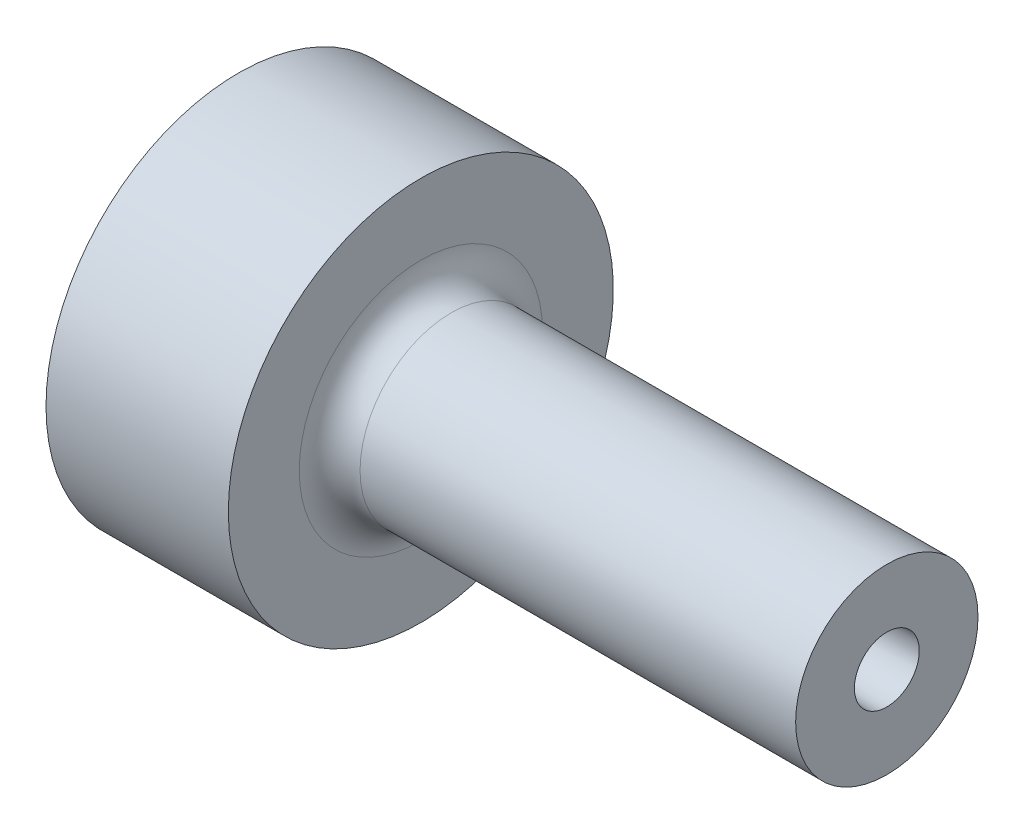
ISO-10303-21;
HEADER;
FILE_DESCRIPTION(('STEP AP214'),'2;1');
FILE_NAME('part.step','',(''),(''),'','','');
FILE_SCHEMA(('AUTOMOTIVE_DESIGN { 1 0 10303 214 1 1 1 1 }'));
ENDSEC;
DATA;
#1=APPLICATION_CONTEXT('core data for automotive mechanical design processes');
#2=APPLICATION_PROTOCOL_DEFINITION('international standard','automotive_design',2000,#1);
#3=PRODUCT_CONTEXT('',#1,'mechanical');
#4=PRODUCT('Part','Part','',(#3));
#5=PRODUCT_RELATED_PRODUCT_CATEGORY('part','',(#4));
#6=PRODUCT_DEFINITION_FORMATION('','',#4);
#7=PRODUCT_DEFINITION_CONTEXT('part definition',#1,'design');
#8=PRODUCT_DEFINITION('design','',#6,#7);
#9=PRODUCT_DEFINITION_SHAPE('','',#8);
#10=(LENGTH_UNIT() NAMED_UNIT(*) SI_UNIT(.MILLI.,.METRE.));
#11=(NAMED_UNIT(*) PLANE_ANGLE_UNIT() SI_UNIT($,.RADIAN.));
#12=(NAMED_UNIT(*) SI_UNIT($,.STERADIAN.) SOLID_ANGLE_UNIT());
#13=UNCERTAINTY_MEASURE_WITH_UNIT(LENGTH_MEASURE(1.E-05),#10,'distance_accuracy_value','');
#14=(GEOMETRIC_REPRESENTATION_CONTEXT(3) GLOBAL_UNCERTAINTY_ASSIGNED_CONTEXT((#13)) GLOBAL_UNIT_ASSIGNED_CONTEXT((#10,
#11,#12)) REPRESENTATION_CONTEXT('',''));
#15=CARTESIAN_POINT('',(0.,0.,0.));
#16=DIRECTION('',(0.,0.,1.));
#17=DIRECTION('',(1.,0.,0.));
#18=AXIS2_PLACEMENT_3D('',#15,#16,#17);
#19=CARTESIAN_POINT('',(0.,0.,0.));
#20=DIRECTION('',(-1.,0.,0.));
#21=DIRECTION('',(0.,0.,1.));
#22=AXIS2_PLACEMENT_3D('',#19,#20,#21);
#23=CYLINDRICAL_SURFACE('',#22,19.);
#24=CARTESIAN_POINT('',(18.,0.,0.));
#25=DIRECTION('',(-1.,0.,0.));
#26=DIRECTION('',(0.,0.,1.));
#27=AXIS2_PLACEMENT_3D('',#24,#25,#26);
#28=CIRCLE('',#27,19.);
#29=CARTESIAN_POINT('',(18.,0.,19.));
#30=VERTEX_POINT('',#29);
#31=EDGE_CURVE('E91',#30,#30,#28,.T.);
#32=ORIENTED_EDGE('',*,*,#31,.T.);
#33=EDGE_LOOP('',(#32));
#34=FACE_BOUND('',#33,.T.);
#35=CARTESIAN_POINT('',(0.,0.,0.));
#36=DIRECTION('',(-1.,0.,0.));
#37=DIRECTION('',(0.,0.,1.));
#38=AXIS2_PLACEMENT_3D('',#35,#36,#37);
#39=CIRCLE('',#38,19.);
#40=CARTESIAN_POINT('',(0.,0.,19.));
#41=VERTEX_POINT('',#40);
#42=EDGE_CURVE('E85',#41,#41,#39,.T.);
#43=ORIENTED_EDGE('',*,*,#42,.F.);
#44=EDGE_LOOP('',(#43));
#45=FACE_BOUND('',#44,.T.);
#46=CARTESIAN_POINT('',(11.,-19.,0.));
#47=CARTESIAN_POINT('',(10.9999951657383,-18.9999986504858,0.11200841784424));
#48=CARTESIAN_POINT('',(10.9905588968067,-18.9989990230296,0.224090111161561));
#49=CARTESIAN_POINT('',(10.953059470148,-18.9951074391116,0.445143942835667));
#50=CARTESIAN_POINT('',(10.9249759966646,-18.9922134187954,0.554112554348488));
#51=CARTESIAN_POINT('',(10.8510107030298,-18.9848596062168,0.765707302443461));
#52=CARTESIAN_POINT('',(10.8051398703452,-18.9804007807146,0.868337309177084));
#53=CARTESIAN_POINT('',(10.696923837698,-18.9704154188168,1.06441973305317));
#54=CARTESIAN_POINT('',(10.6345818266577,-18.9648890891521,1.15787392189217));
#55=CARTESIAN_POINT('',(10.494927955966,-18.9533628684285,1.33334438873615));
#56=CARTESIAN_POINT('',(10.417564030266,-18.9473613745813,1.41531912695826));
#57=CARTESIAN_POINT('',(10.2501736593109,-18.9355744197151,1.565146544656));
#58=CARTESIAN_POINT('',(10.1601466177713,-18.9297889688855,1.63299855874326));
#59=CARTESIAN_POINT('',(9.96972339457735,-18.9190729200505,1.75280323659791));
#60=CARTESIAN_POINT('',(9.86930325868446,-18.914144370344,1.80471802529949));
#61=CARTESIAN_POINT('',(9.66111022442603,-18.9057203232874,1.89093273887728));
#62=CARTESIAN_POINT('',(9.55333752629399,-18.90222478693,1.92523314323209));
#63=CARTESIAN_POINT('',(9.333924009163,-18.8970772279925,1.97512160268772));
#64=CARTESIAN_POINT('',(9.22229908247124,-18.89541839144,1.99077883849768));
#65=CARTESIAN_POINT('',(8.99799439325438,-18.8941109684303,2.0031504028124));
#66=CARTESIAN_POINT('',(8.88531466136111,-18.8944623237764,1.99986527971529));
#67=CARTESIAN_POINT('',(8.66257681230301,-18.8971293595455,1.97450235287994));
#68=CARTESIAN_POINT('',(8.55250997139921,-18.8994371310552,1.9525002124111));
#69=CARTESIAN_POINT('',(8.33763983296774,-18.9057446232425,1.89044560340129));
#70=CARTESIAN_POINT('',(8.23283661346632,-18.9097443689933,1.85039286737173));
#71=CARTESIAN_POINT('',(8.0312304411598,-18.9189942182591,1.75329092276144));
#72=CARTESIAN_POINT('',(7.93444370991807,-18.924246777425,1.69620827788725));
#73=CARTESIAN_POINT('',(7.75179548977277,-18.9354083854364,1.5666908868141));
#74=CARTESIAN_POINT('',(7.66593435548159,-18.9413174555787,1.49425564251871));
#75=CARTESIAN_POINT('',(7.50713503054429,-18.9531615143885,1.33566725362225));
#76=CARTESIAN_POINT('',(7.43426205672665,-18.9590964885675,1.24944878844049));
#77=CARTESIAN_POINT('',(7.30401357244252,-18.9702964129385,1.06596783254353));
#78=CARTESIAN_POINT('',(7.24663808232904,-18.9755613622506,0.968705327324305));
#79=CARTESIAN_POINT('',(7.14901535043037,-18.9848300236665,0.765851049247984));
#80=CARTESIAN_POINT('',(7.10877156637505,-18.9888334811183,0.660257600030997));
#81=CARTESIAN_POINT('',(7.04660317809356,-18.9951255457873,0.443760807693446));
#82=CARTESIAN_POINT('',(7.02467796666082,-18.9974142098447,0.332857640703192));
#83=CARTESIAN_POINT('',(6.9998521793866,-19.0000115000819,0.109454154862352));
#84=CARTESIAN_POINT('',(6.9968616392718,-19.0003294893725,-0.00303606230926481));
#85=CARTESIAN_POINT('',(7.00975357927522,-18.9989747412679,-0.226916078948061));
#86=CARTESIAN_POINT('',(7.02563577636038,-18.9973020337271,-0.338305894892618));
#87=CARTESIAN_POINT('',(7.07574769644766,-18.9921598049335,-0.556562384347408));
#88=CARTESIAN_POINT('',(7.10993514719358,-18.9886944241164,-0.663438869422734));
#89=CARTESIAN_POINT('',(7.1956435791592,-18.9803554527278,-0.869940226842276));
#90=CARTESIAN_POINT('',(7.24716498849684,-18.9754818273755,-0.969564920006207));
#91=CARTESIAN_POINT('',(7.36630089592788,-18.9648478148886,-1.1591405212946));
#92=CARTESIAN_POINT('',(7.43397432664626,-18.9590842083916,-1.2490542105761));
#93=CARTESIAN_POINT('',(7.58340899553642,-18.9473268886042,-1.4162783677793));
#94=CARTESIAN_POINT('',(7.665170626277,-18.9413331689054,-1.49358848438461));
#95=CARTESIAN_POINT('',(7.84085406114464,-18.9297628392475,-1.63372463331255));
#96=CARTESIAN_POINT('',(7.93482318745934,-18.9241879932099,-1.69649150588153));
#97=CARTESIAN_POINT('',(8.13202150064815,-18.9141138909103,-1.80535237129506));
#98=CARTESIAN_POINT('',(8.23525054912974,-18.9096146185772,-1.85144661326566));
#99=CARTESIAN_POINT('',(8.44783784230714,-18.9022123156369,-1.9255553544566));
#100=CARTESIAN_POINT('',(8.55718382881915,-18.8993062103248,-1.95360469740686));
#101=CARTESIAN_POINT('',(8.77906579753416,-18.8954098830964,-1.99094032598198));
#102=CARTESIAN_POINT('',(8.89160167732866,-18.8944195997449,-2.00022721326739));
#103=CARTESIAN_POINT('',(9.11608086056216,-18.8944684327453,-1.99976544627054));
#104=CARTESIAN_POINT('',(9.22802436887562,-18.8954976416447,-1.99010972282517));
#105=CARTESIAN_POINT('',(9.4486892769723,-18.8994483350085,-1.95223204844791));
#106=CARTESIAN_POINT('',(9.55741067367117,-18.9023698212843,-1.92401007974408));
#107=CARTESIAN_POINT('',(9.76854219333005,-18.9097730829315,-1.8498273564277));
#108=CARTESIAN_POINT('',(9.87095340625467,-18.914254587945,-1.80386967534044));
#109=CARTESIAN_POINT('',(10.0666237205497,-18.92427346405,-1.69552954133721));
#110=CARTESIAN_POINT('',(10.1598828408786,-18.9298108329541,-1.63314712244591));
#111=CARTESIAN_POINT('',(10.3350778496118,-18.9413500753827,-1.49337993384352));
#112=CARTESIAN_POINT('',(10.4169583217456,-18.9473540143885,-1.41592586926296));
#113=CARTESIAN_POINT('',(10.5665993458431,-18.9591311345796,-1.24835332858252));
#114=CARTESIAN_POINT('',(10.6343565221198,-18.9649042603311,-1.15823183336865));
#115=CARTESIAN_POINT('',(10.7539774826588,-18.975586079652,-0.967607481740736));
#116=CARTESIAN_POINT('',(10.8057969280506,-18.9804923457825,-0.867076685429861));
#117=CARTESIAN_POINT('',(10.8917493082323,-18.9888617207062,-0.658751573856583));
#118=CARTESIAN_POINT('',(10.9259020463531,-18.9923264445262,-0.550965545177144));
#119=CARTESIAN_POINT('',(10.9671005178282,-18.9965585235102,-0.368815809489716));
#120=CARTESIAN_POINT('',(10.9794208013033,-18.9978430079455,-0.295613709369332));
#121=CARTESIAN_POINT('',(10.9958721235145,-18.9995641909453,-0.148285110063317));
#122=CARTESIAN_POINT('',(11.0000032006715,-19.0000008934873,-0.0741586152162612));
#123=CARTESIAN_POINT('',(11.,-19.,0.));
#124=B_SPLINE_CURVE_WITH_KNOTS('',3,(#46,#47,#48,#49,#50,#51,#52,#53,#54,#55,#56,#57,#58,#59,
#60,#61,#62,#63,#64,#65,#66,#67,#68,#69,#70,#71,#72,#73,#74,#75,#76,#77,#78,#79,#80,#81,#82,#83,
#84,#85,#86,#87,#88,#89,#90,#91,#92,#93,#94,#95,#96,#97,#98,#99,#100,#101,#102,#103,#104,#105,
#106,#107,#108,#109,#110,#111,#112,#113,#114,#115,#116,#117,#118,#119,#120,#121,#122,#123),
.UNSPECIFIED.,.T.,.F.,(4,2,2,2,2,2,2,2,2,2,2,2,2,2,2,2,2,2,2,2,2,2,2,2,2,2,2,2,2,2,2,2,2,2,2,2,
2,2,4),(0.,0.335754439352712,0.671875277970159,1.00778882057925,1.34363737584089,
1.68067146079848,2.01772142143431,2.35556629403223,2.69340196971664,3.02998006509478,
3.36654841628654,3.7017626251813,4.03698180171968,4.37286352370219,4.70875614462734,
5.0462905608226,5.38382542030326,5.72142837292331,6.05902013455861,6.39500668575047,
6.73098819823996,7.06619715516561,7.40141439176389,7.73787392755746,8.07434284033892,
8.41215732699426,8.74996676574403,9.08712193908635,9.42426630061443,9.75976079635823,
10.095255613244,10.4306923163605,10.7661283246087,11.103144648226,11.4402414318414,
11.7782677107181,12.1159142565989,12.3382118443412,12.5605083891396),.UNSPECIFIED.);
#125=CARTESIAN_POINT('',(11.,-19.,0.));
#126=VERTEX_POINT('',#125);
#127=EDGE_CURVE('E10',#126,#126,#124,.T.);
#128=ORIENTED_EDGE('',*,*,#127,.F.);
#129=EDGE_LOOP('',(#128));
#130=FACE_BOUND('',#129,.T.);
#131=ADVANCED_FACE('F16',(#34,#45,#130),#23,.T.);
#132=CARTESIAN_POINT('',(0.,0.,0.));
#133=DIRECTION('',(1.,0.,0.));
#134=DIRECTION('',(0.,0.,-1.));
#135=AXIS2_PLACEMENT_3D('',#132,#133,#134);
#136=CONICAL_SURFACE('',#135,1.75,0.0226892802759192);
#137=CARTESIAN_POINT('',(64.,0.,0.));
#138=DIRECTION('',(-1.,0.,0.));
#139=DIRECTION('',(0.,0.,1.));
#140=AXIS2_PLACEMENT_3D('',#137,#138,#139);
#141=CIRCLE('',#140,3.20236317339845);
#142=CARTESIAN_POINT('',(64.,0.,3.20236317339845));
#143=VERTEX_POINT('',#142);
#144=EDGE_CURVE('E77',#143,#143,#141,.T.);
#145=ORIENTED_EDGE('',*,*,#144,.F.);
#146=EDGE_LOOP('',(#145));
#147=FACE_BOUND('',#146,.T.);
#148=CARTESIAN_POINT('',(3.86351757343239,0.,0.));
#149=DIRECTION('',(-1.,0.,0.));
#150=DIRECTION('',(0.,0.,1.));
#151=AXIS2_PLACEMENT_3D('',#148,#149,#150);
#152=CIRCLE('',#151,1.83767547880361);
#153=CARTESIAN_POINT('',(3.86351757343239,0.,1.83767547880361));
#154=VERTEX_POINT('',#153);
#155=EDGE_CURVE('E97',#154,#154,#152,.F.);
#156=ORIENTED_EDGE('',*,*,#155,.F.);
#157=EDGE_LOOP('',(#156));
#158=FACE_BOUND('',#157,.T.);
#159=ADVANCED_FACE('F44',(#147,#158),#136,.F.);
#160=CARTESIAN_POINT('',(21.,0.,0.));
#161=DIRECTION('',(-1.,0.,0.));
#162=DIRECTION('',(0.,0.,1.));
#163=AXIS2_PLACEMENT_3D('',#160,#161,#162);
#164=TOROIDAL_SURFACE('',#163,12.,3.);
#165=CARTESIAN_POINT('',(18.,0.,0.));
#166=DIRECTION('',(-1.,0.,0.));
#167=DIRECTION('',(0.,0.,1.));
#168=AXIS2_PLACEMENT_3D('',#165,#166,#167);
#169=CIRCLE('',#168,12.);
#170=CARTESIAN_POINT('',(18.,0.,12.));
#171=VERTEX_POINT('',#170);
#172=EDGE_CURVE('E93',#171,#171,#169,.T.);
#173=ORIENTED_EDGE('',*,*,#172,.F.);
#174=EDGE_LOOP('',(#173));
#175=FACE_BOUND('',#174,.T.);
#176=CARTESIAN_POINT('',(21.,0.,0.));
#177=DIRECTION('',(-1.,0.,0.));
#178=DIRECTION('',(0.,0.,1.));
#179=AXIS2_PLACEMENT_3D('',#176,#177,#178);
#180=CIRCLE('',#179,9.);
#181=CARTESIAN_POINT('',(21.,0.,9.));
#182=VERTEX_POINT('',#181);
#183=EDGE_CURVE('E29',#182,#182,#180,.T.);
#184=ORIENTED_EDGE('',*,*,#183,.T.);
#185=EDGE_LOOP('',(#184));
#186=FACE_BOUND('',#185,.T.);
#187=ADVANCED_FACE('F18',(#175,#186),#164,.F.);
#188=CARTESIAN_POINT('',(0.,0.,0.));
#189=DIRECTION('',(-1.,0.,0.));
#190=DIRECTION('',(0.,0.,1.));
#191=AXIS2_PLACEMENT_3D('',#188,#189,#190);
#192=CYLINDRICAL_SURFACE('',#191,9.);
#193=ORIENTED_EDGE('',*,*,#183,.F.);
#194=EDGE_LOOP('',(#193));
#195=FACE_BOUND('',#194,.T.);
#196=CARTESIAN_POINT('',(64.,0.,0.));
#197=DIRECTION('',(-1.,0.,0.));
#198=DIRECTION('',(0.,0.,1.));
#199=AXIS2_PLACEMENT_3D('',#196,#197,#198);
#200=CIRCLE('',#199,9.);
#201=CARTESIAN_POINT('',(64.,0.,9.));
#202=VERTEX_POINT('',#201);
#203=EDGE_CURVE('E75',#202,#202,#200,.T.);
#204=ORIENTED_EDGE('',*,*,#203,.T.);
#205=EDGE_LOOP('',(#204));
#206=FACE_BOUND('',#205,.T.);
#207=ADVANCED_FACE('F63',(#195,#206),#192,.T.);
#208=CARTESIAN_POINT('',(64.,9.,0.));
#209=DIRECTION('',(-1.,0.,0.));
#210=DIRECTION('',(0.,0.,1.));
#211=AXIS2_PLACEMENT_3D('',#208,#209,#210);
#212=PLANE('',#211);
#213=ORIENTED_EDGE('',*,*,#203,.F.);
#214=EDGE_LOOP('',(#213));
#215=FACE_BOUND('',#214,.T.);
#216=ORIENTED_EDGE('',*,*,#144,.T.);
#217=EDGE_LOOP('',(#216));
#218=FACE_BOUND('',#217,.T.);
#219=ADVANCED_FACE('F59',(#215,#218),#212,.F.);
#220=CARTESIAN_POINT('',(0.,1.75,0.));
#221=DIRECTION('',(1.,0.,0.));
#222=DIRECTION('',(0.,0.,-1.));
#223=AXIS2_PLACEMENT_3D('',#220,#221,#222);
#224=PLANE('',#223);
#225=CARTESIAN_POINT('',(0.,0.,0.));
#226=DIRECTION('',(-1.,0.,0.));
#227=DIRECTION('',(0.,0.,1.));
#228=AXIS2_PLACEMENT_3D('',#225,#226,#227);
#229=CIRCLE('',#228,15.5);
#230=CARTESIAN_POINT('',(0.,0.,15.5));
#231=VERTEX_POINT('',#230);
#232=EDGE_CURVE('E101',#231,#231,#229,.T.);
#233=ORIENTED_EDGE('',*,*,#232,.F.);
#234=EDGE_LOOP('',(#233));
#235=FACE_BOUND('',#234,.T.);
#236=ORIENTED_EDGE('',*,*,#42,.T.);
#237=EDGE_LOOP('',(#236));
#238=FACE_BOUND('',#237,.T.);
#239=ADVANCED_FACE('F57',(#235,#238),#224,.F.);
#240=CARTESIAN_POINT('',(18.,19.,0.));
#241=DIRECTION('',(-1.,0.,0.));
#242=DIRECTION('',(0.,0.,1.));
#243=AXIS2_PLACEMENT_3D('',#240,#241,#242);
#244=PLANE('',#243);
#245=ORIENTED_EDGE('',*,*,#31,.F.);
#246=EDGE_LOOP('',(#245));
#247=FACE_BOUND('',#246,.T.);
#248=ORIENTED_EDGE('',*,*,#172,.T.);
#249=EDGE_LOOP('',(#248));
#250=FACE_BOUND('',#249,.T.);
#251=ADVANCED_FACE('F55',(#247,#250),#244,.F.);
#252=CARTESIAN_POINT('',(-35.9477938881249,0.,0.));
#253=DIRECTION('',(-1.,0.,0.));
#254=DIRECTION('',(0.,0.,1.));
#255=AXIS2_PLACEMENT_3D('',#252,#253,#254);
#256=DEGENERATE_TOROIDAL_SURFACE('',#255,2.0429790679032,40.,.F.);
#257=ORIENTED_EDGE('',*,*,#232,.T.);
#258=EDGE_LOOP('',(#257));
#259=FACE_BOUND('',#258,.T.);
#260=ORIENTED_EDGE('',*,*,#155,.T.);
#261=EDGE_LOOP('',(#260));
#262=FACE_BOUND('',#261,.T.);
#263=ADVANCED_FACE('F40',(#259,#262),#256,.T.);
#264=CARTESIAN_POINT('',(9.,-19.,0.));
#265=DIRECTION('',(0.,-1.,0.));
#266=DIRECTION('',(1.,0.,0.));
#267=AXIS2_PLACEMENT_3D('',#264,#265,#266);
#268=CYLINDRICAL_SURFACE('',#267,2.);
#269=CARTESIAN_POINT('',(9.,-13.,0.));
#270=DIRECTION('',(0.,-1.,0.));
#271=DIRECTION('',(1.,0.,0.));
#272=AXIS2_PLACEMENT_3D('',#269,#270,#271);
#273=CIRCLE('',#272,2.);
#274=CARTESIAN_POINT('',(11.,-13.,0.));
#275=VERTEX_POINT('',#274);
#276=EDGE_CURVE('E105',#275,#275,#273,.T.);
#277=ORIENTED_EDGE('',*,*,#276,.F.);
#278=EDGE_LOOP('',(#277));
#279=FACE_BOUND('',#278,.T.);
#280=ORIENTED_EDGE('',*,*,#127,.T.);
#281=EDGE_LOOP('',(#280));
#282=FACE_BOUND('',#281,.T.);
#283=ADVANCED_FACE('F34',(#279,#282),#268,.F.);
#284=CARTESIAN_POINT('',(9.,-11.8452994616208,0.));
#285=DIRECTION('',(0.,-1.,0.));
#286=DIRECTION('',(1.,0.,0.));
#287=AXIS2_PLACEMENT_3D('',#284,#285,#286);
#288=CONICAL_SURFACE('',#287,0.,1.0471975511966);
#289=ORIENTED_EDGE('',*,*,#276,.T.);
#290=EDGE_LOOP('',(#289));
#291=FACE_BOUND('',#290,.T.);
#292=CARTESIAN_POINT('',(9.,-11.8452994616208,0.));
#293=VERTEX_POINT('',#292);
#294=VERTEX_LOOP('',#293);
#295=FACE_BOUND('',#294,.T.);
#296=ADVANCED_FACE('F32',(#291,#295),#288,.F.);
#297=CLOSED_SHELL('',(#131,#159,#187,#207,#219,#239,#251,#263,#283,#296));
#298=MANIFOLD_SOLID_BREP('B1',#297);
#299=ADVANCED_BREP_SHAPE_REPRESENTATION('',(#18,#298),#14);
#300=SHAPE_DEFINITION_REPRESENTATION(#9,#299);
ENDSEC;
END-ISO-10303-21;
